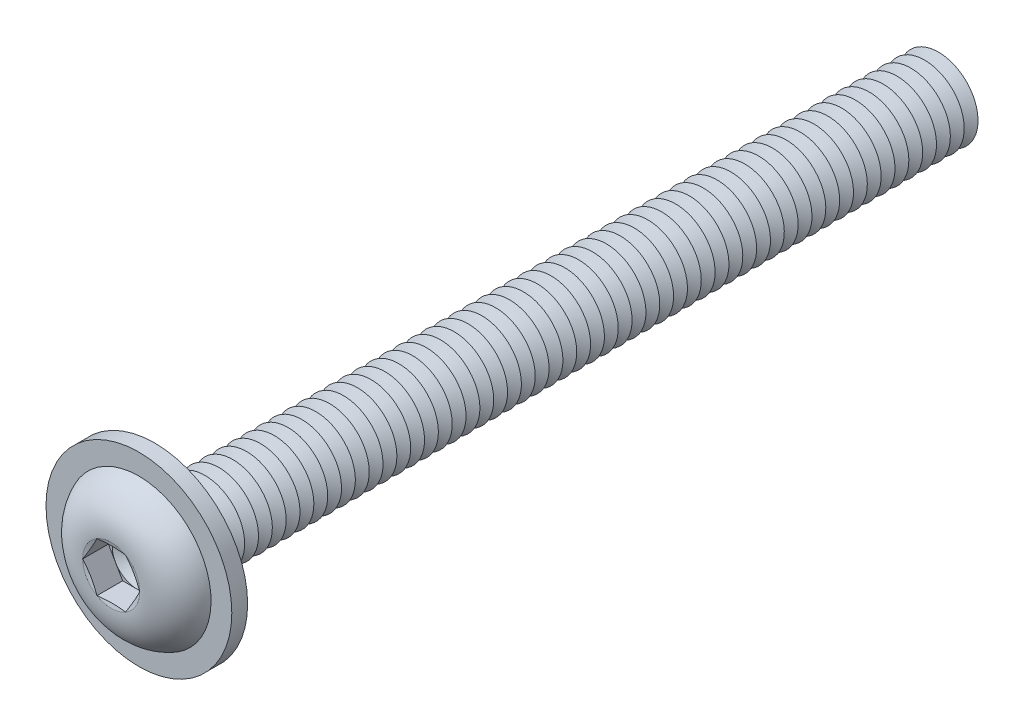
from build123d import *

# Parameters (mm, degrees)
FILLET1_R           = 0.35
LPATTERN1_COUNT     = 57
LPATTERN1_PITCH     = 0.7
CUT_EXTRUDE1_DEPTH  = 1.3
SKETCH5_R           = 4.7
SKETCH5_R_2         = 2.35
BOSS_EXTRUDE1_DEPTH = 0.8


with BuildPart() as part:
    # Sketch1 → Revolve1 (revolve)
    with BuildSketch(Plane(origin=(0, 0, 0), x_dir=(0, 0, -1), z_dir=(1, 0, 0))):
        with BuildLine():
            Line((0, 2), (0, 3.8))
            ThreePointArc((0, 3.8), (-1.611961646, 3.099623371), (-2.2, 1.443375))
            Line((-2.2, 1.443375), (-2.006624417, 0.7216875))
            Line((-2.006624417, 0.7216875), (-2.2, 0.7216875))
            Line((-2.2, 0.7216875), (-2.2, 0))
            Line((-2.2, 0), (40, 0))
            Line((40, 0), (40, 2))
            Line((40, 2), (0, 2))
        make_face()
    revolve(axis=Axis((0, 0, -40), (0, 0, 1)))

    # Fillet1
    fillet1_edges = [part.edges().sort_by_distance(p)[0] for p in [
        (0, -2, 0),
    ]]
    fillet(fillet1_edges, radius=FILLET1_R)

    # Sketch2 → Cut-Revolve1 (revolve, cut)
    with BuildSketch(Plane(origin=(0, 0, 0), x_dir=(0, 0, -1), z_dir=(1, 0, 0))):
        Polygon((39.65, 2), (40.35, 2), (40, 1.393782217), align=None)
    cut_revolve1 = revolve(axis=Axis((0, 0, -40), (0, 0, -1)), mode=Mode.SUBTRACT)

    # LPattern1: Cut-Revolve1 ×57
    with Locations(*[(0, 0, i * LPATTERN1_PITCH) for i in range(1, LPATTERN1_COUNT)]):
        add(cut_revolve1, mode=Mode.SUBTRACT)

    # Sketch3 → Cut-Extrude1 (cut)
    with BuildSketch(Plane.XY.offset(2.2)):
        Polygon((0.7216875, 1.249999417), (-0.7216875, 1.249999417), (-1.443375, 0), (-0.7216875, -1.249999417), (0.7216875, -1.249999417), (1.443375, 0), align=None)
    extrude(amount=-CUT_EXTRUDE1_DEPTH, mode=Mode.SUBTRACT)

    # Cut-Extrude2 cone 1 section (on through the dimple's axis) → Cut-Extrude2 (revolve, cut)
    with BuildSketch(Plane(origin=(0, 0, 0.9), x_dir=(0, -1, 0), z_dir=(1, 0, 0))):
        Polygon((0, 0), (1.249999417, 0), (0, 0.7216875), align=None)
    revolve(axis=Axis((0, 0, 0.9), (0, 0, -1)), mode=Mode.SUBTRACT)

    # Sketch5 → Boss-Extrude1 (add)
    with BuildSketch(Plane(origin=(0, 0, 0), x_dir=(-1, 0, 0), z_dir=(0, 0, -1))):
        with Locations(Location((0, 0, 0), (0, 0, 90))):
            Circle(SKETCH5_R)
        Circle(SKETCH5_R_2, mode=Mode.SUBTRACT)
    extrude(amount=-BOSS_EXTRUDE1_DEPTH)


solid = part.part
